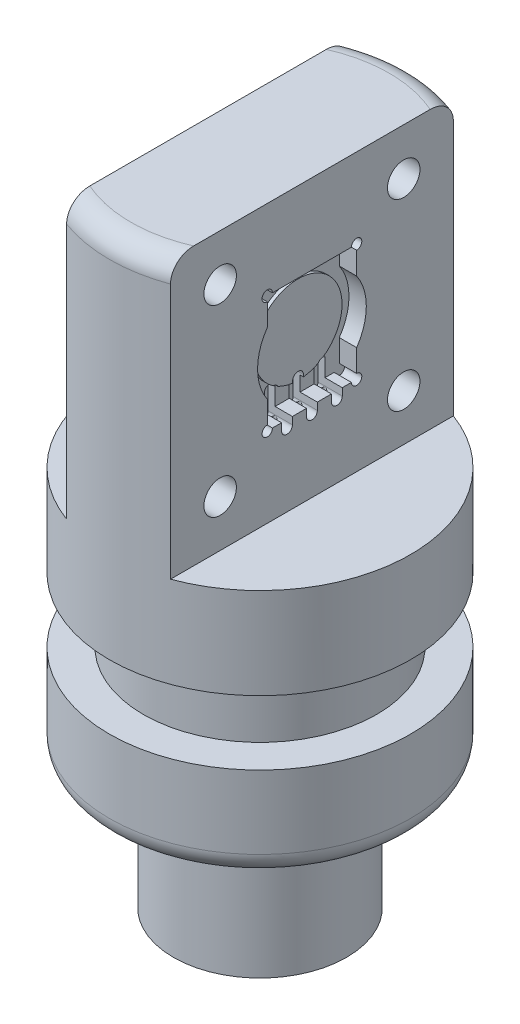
from build123d import *

# Parameters (mm, degrees)
FILLET1_R               = 0.7874
SKETCH2_W               = 4.710894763
SKETCH2_H               = 10.16
FLAT_FOR_CHIP_DEPTH     = 26.363302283
SKETCH3_W               = 3.2766
SKETCH3_H               = 4.2926
CHIP_POCKET_DEPTH       = 0.508
SKETCH6_R               = 0.1905
CORNER_HOLES_DEPTH      = 0.635
SKETCH5_R               = 1.6129
PEDESTAL_DEPTH          = 0.635
SLOTS_DEPTH             = 0.889
SKETCH8_R               = 0.19812
ANGLED_WIRE_HOLES_DEPTH = 4.318
SKETCH10_R              = 0.59563
SCREW_HOLES_DEPTH       = 5.08


with BuildPart() as part:
    # Sketch1 → Revolve1 (revolve)
    with BuildSketch(Plane.XY, mode=Mode.PRIVATE) as revolve1_sk:
        with BuildLine():
            Line((0, 0), (0, 24.13))
            Line((0, 24.13), (5.5245, 24.13))
            Line((5.5245, 24.13), (5.5245, 10.6299))
            Line((5.5245, 10.6299), (4.2799, 10.6299))
            Line((4.2799, 10.6299), (4.2799, 8.2677))
            Line((4.2799, 8.2677), (5.5245, 8.2677))
            Line((5.5245, 8.2677), (5.5245, 5.588))
            ThreePointArc((5.5245, 5.588), (5.286436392, 5.013263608), (4.7117, 4.7752))
            Line((4.7117, 4.7752), (2.6162, 4.7752))
            Line((2.6162, 4.7752), (2.6162, 3.8862))
            Line((2.6162, 3.8862), (3.175, 3.8862))
            Line((3.175, 3.8862), (3.175, 0))
            Line((3.175, 0), (0, 0))
        make_face()
    revolve(revolve1_sk.sketch.rotate(Axis((0, 0, 0), (0, -1, 0)), 90), axis=Axis((0, 0, 0), (0, -1, 0)))

    # Fillet1
    fillet1_edges = [part.edges().sort_by_distance(p)[0] for p in [
        (0, 24.13, -5.5245),
    ]]
    fillet(fillet1_edges, radius=FILLET1_R)

    # Sketch2 → Flat for chip (cut, symmetric)
    with BuildSketch(Plane.XY):
        with Locations((4.260447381, 19.05)):
            Rectangle(SKETCH2_W, SKETCH2_H)
    flat_for_chip = extrude(amount=FLAT_FOR_CHIP_DEPTH, both=True, mode=Mode.SUBTRACT)

    # Mirrored flat: Flat for chip across plane
    add(flat_for_chip.mirror(Plane(origin=(0, 0, 0), x_dir=(0, 0, 1), z_dir=(1, 0, 0))), mode=Mode.SUBTRACT)

    # Sketch3 → Chip Pocket (cut)
    with BuildSketch(Plane(origin=(1.905, 0, 0), x_dir=(0, 0, -1), z_dir=(1, 0, 0))):
        with Locations((0, 19.05)):
            Rectangle(SKETCH3_W, SKETCH3_H)
    extrude(amount=-CHIP_POCKET_DEPTH, mode=Mode.SUBTRACT)

    # Sketch6 → Corner Holes (cut)
    with BuildSketch(Plane(origin=(1.905, 0, 0), x_dir=(0, 0, -1), z_dir=(1, 0, 0))):
        with Locations(Location((-1.6383, 16.9037, 0), (0, 0, 90))):
            Circle(SKETCH6_R)
        with Locations(Location((-1.6383, 21.1963, 0), (0, 0, 90))):
            Circle(SKETCH6_R)
        with Locations(Location((1.6383, 21.1963, 0), (0, 0, 90))):
            Circle(SKETCH6_R)
        with Locations(Location((1.6383, 16.9037, 0), (0, 0, 90))):
            Circle(SKETCH6_R)
    extrude(amount=-CORNER_HOLES_DEPTH, mode=Mode.SUBTRACT)

    # Sketch5 → Pedestal (cut)
    with BuildSketch(Plane(origin=(1.905, 0, 0), x_dir=(0, 0, -1), z_dir=(1, 0, 0))):
        with BuildLine():
            Line((-1.6383, 21.1963), (-1.6383, 20.186490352))
            ThreePointArc((-1.6383, 20.186490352), (-1.9939, 19.05), (-1.6383, 17.913509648))
            Line((-1.6383, 17.913509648), (-1.6383, 16.9037))
            Line((-1.6383, 16.9037), (1.6383, 16.9037))
            Line((1.6383, 16.9037), (1.6383, 17.913509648))
            ThreePointArc((1.6383, 17.913509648), (1.9939, 19.05), (1.6383, 20.186490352))
            Line((1.6383, 20.186490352), (1.6383, 21.1963))
            Line((1.6383, 21.1963), (-1.6383, 21.1963))
        make_face()
        with Locations(Location((0, 19.05, 0), (0, 0, 90))):
            Circle(SKETCH5_R, mode=Mode.SUBTRACT)
    extrude(amount=-PEDESTAL_DEPTH, mode=Mode.SUBTRACT)

    # Sketch7 → Slots (cut)
    with BuildSketch(Plane(origin=(1.905, 0, 0), x_dir=(0, 0, -1), z_dir=(1, 0, 0))):
        with BuildLine():
            Line((-1.11252, 16.637), (-1.11252, 17.526))
            ThreePointArc((-1.11252, 17.526), (-0.9144, 17.72412), (-0.71628, 17.526))
            Line((-0.71628, 17.526), (-0.71628, 16.637))
            ThreePointArc((-0.71628, 16.637), (-0.9144, 16.43888), (-1.11252, 16.637))
        make_face()
        with BuildLine():
            Line((-0.19812, 16.637), (-0.19812, 17.526))
            ThreePointArc((-0.19812, 17.526), (0, 17.72412), (0.19812, 17.526))
            Line((0.19812, 17.526), (0.19812, 16.637))
            ThreePointArc((0.19812, 16.637), (0, 16.43888), (-0.19812, 16.637))
        make_face()
        with BuildLine():
            Line((0.71628, 16.637), (0.71628, 17.526))
            ThreePointArc((0.71628, 17.526), (0.9144, 17.72412), (1.11252, 17.526))
            Line((1.11252, 17.526), (1.11252, 16.637))
            ThreePointArc((1.11252, 16.637), (0.9144, 16.43888), (0.71628, 16.637))
        make_face()
    extrude(amount=-SLOTS_DEPTH, mode=Mode.SUBTRACT)

    # Sketch8 → Angled Wire Holes (cut)
    with BuildSketch(Plane(origin=(5.655587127, 15.538597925, 0), x_dir=(0, 0, -1), z_dir=(0.34202014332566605, 0.9396926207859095, 0))):
        with Locations(Location((0, 4.469580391, 0), (0, 0, 90))):
            Circle(SKETCH8_R)
        with Locations(Location((0.9144, 4.469580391, 0), (0, 0, 90))):
            Circle(SKETCH8_R)
        with Locations(Location((-0.9144, 4.469580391, 0), (0, 0, 90))):
            Circle(SKETCH8_R)
    extrude(amount=-ANGLED_WIRE_HOLES_DEPTH, mode=Mode.SUBTRACT)

    # Sketch9 → CenterHole (revolve, cut)
    with BuildSketch(Plane.XY, mode=Mode.PRIVATE) as centerhole_sk:
        Polygon((0, 0), (1.3843, 0), (1.3843, 7.62), (1.1303, 7.772618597), (1.1303, 13.0937), (0, 13.772852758), align=None)
    revolve(centerhole_sk.sketch.rotate(Axis((0, 0, 0), (0, -1, 0)), 90), axis=Axis((0, 0, 0), (0, -1, 0)), mode=Mode.SUBTRACT)

    # Sketch10 → Screw holes (cut)
    with BuildSketch(Plane(origin=(1.905, 0, 0), x_dir=(0, 0, -1), z_dir=(1, 0, 0))):
        with Locations(Location((-3.3655, 22.4155, 0), (0, 0, 90))):
            Circle(SKETCH10_R)
        with Locations(Location((3.3655, 22.4155, 0), (0, 0, 90))):
            Circle(SKETCH10_R)
        with Locations(Location((-3.3655, 15.6845, 0), (0, 0, 90))):
            Circle(SKETCH10_R)
        with Locations(Location((3.3655, 15.6845, 0), (0, 0, 90))):
            Circle(SKETCH10_R)
    extrude(amount=-SCREW_HOLES_DEPTH, mode=Mode.SUBTRACT)


solid = part.part
